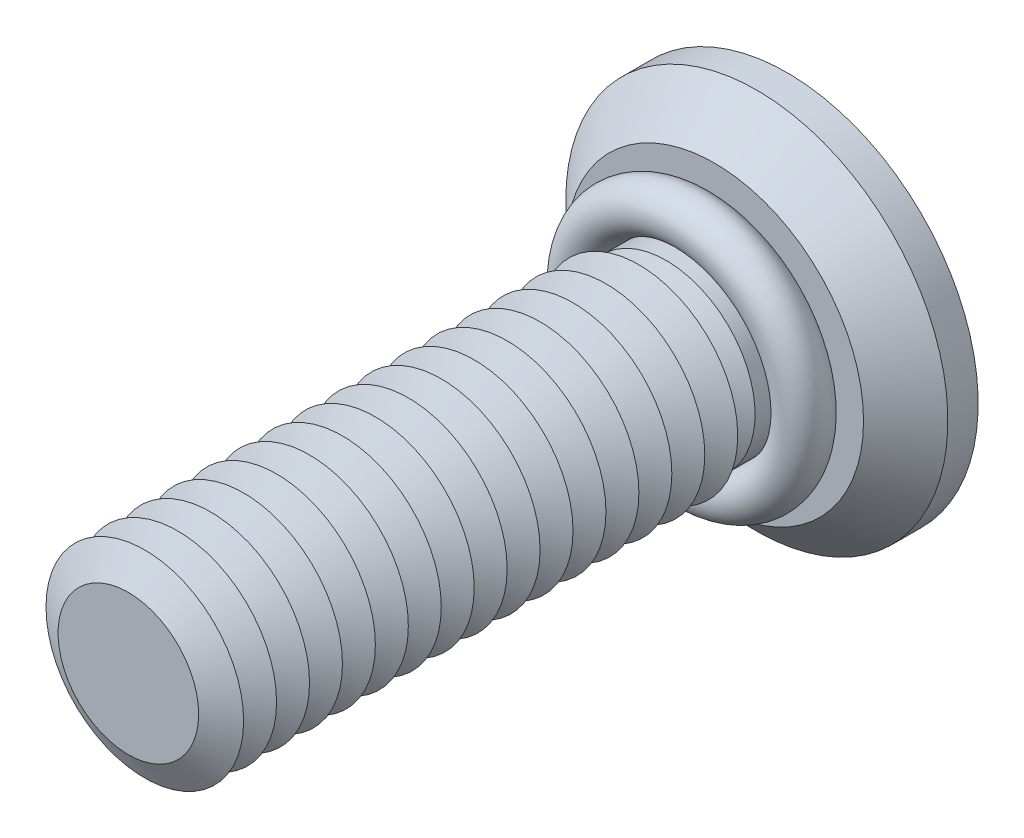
ISO-10303-21;
HEADER;
FILE_DESCRIPTION(('STEP AP214'),'2;1');
FILE_NAME('part.step','',(''),(''),'','','');
FILE_SCHEMA(('AUTOMOTIVE_DESIGN { 1 0 10303 214 1 1 1 1 }'));
ENDSEC;
DATA;
#1=APPLICATION_CONTEXT('core data for automotive mechanical design processes');
#2=APPLICATION_PROTOCOL_DEFINITION('international standard','automotive_design',2000,#1);
#3=PRODUCT_CONTEXT('',#1,'mechanical');
#4=PRODUCT('Part','Part','',(#3));
#5=PRODUCT_RELATED_PRODUCT_CATEGORY('part','',(#4));
#6=PRODUCT_DEFINITION_FORMATION('','',#4);
#7=PRODUCT_DEFINITION_CONTEXT('part definition',#1,'design');
#8=PRODUCT_DEFINITION('design','',#6,#7);
#9=PRODUCT_DEFINITION_SHAPE('','',#8);
#10=(LENGTH_UNIT() NAMED_UNIT(*) SI_UNIT(.MILLI.,.METRE.));
#11=(NAMED_UNIT(*) PLANE_ANGLE_UNIT() SI_UNIT($,.RADIAN.));
#12=(NAMED_UNIT(*) SI_UNIT($,.STERADIAN.) SOLID_ANGLE_UNIT());
#13=UNCERTAINTY_MEASURE_WITH_UNIT(LENGTH_MEASURE(1.E-05),#10,'distance_accuracy_value','');
#14=(GEOMETRIC_REPRESENTATION_CONTEXT(3) GLOBAL_UNCERTAINTY_ASSIGNED_CONTEXT((#13)) GLOBAL_UNIT_ASSIGNED_CONTEXT((#10,
#11,#12)) REPRESENTATION_CONTEXT('',''));
#15=CARTESIAN_POINT('',(0.,0.,0.));
#16=DIRECTION('',(0.,0.,1.));
#17=DIRECTION('',(1.,0.,0.));
#18=AXIS2_PLACEMENT_3D('',#15,#16,#17);
#19=CARTESIAN_POINT('',(0.,0.,1.45000000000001));
#20=DIRECTION('',(0.,0.,1.));
#21=DIRECTION('',(1.,0.,0.));
#22=AXIS2_PLACEMENT_3D('',#19,#20,#21);
#23=TOROIDAL_SURFACE('',#22,1.7,0.35);
#24=CARTESIAN_POINT('',(0.,1.7,1.45000000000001));
#25=DIRECTION('',(1.,0.,0.));
#26=DIRECTION('',(0.,0.,-1.));
#27=AXIS2_PLACEMENT_3D('',#24,#25,#26);
#28=CIRCLE('',#27,0.35);
#29=CARTESIAN_POINT('',(0.,2.05,1.45000000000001));
#30=VERTEX_POINT('',#29);
#31=EDGE_CURVE('P0_E10',#30,#30,#28,.T.);
#32=CARTESIAN_POINT('',(0.,0.,1.45000000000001));
#33=DIRECTION('',(0.,0.,1.));
#34=DIRECTION('',(1.,0.,0.));
#35=AXIS2_PLACEMENT_3D('',#32,#33,#34);
#36=CIRCLE('',#35,2.05);
#37=EDGE_CURVE('',#30,#30,#36,.T.);
#38=ORIENTED_EDGE('',*,*,#31,.F.);
#39=ORIENTED_EDGE('',*,*,#31,.T.);
#40=ORIENTED_EDGE('',*,*,#37,.T.);
#41=ORIENTED_EDGE('',*,*,#37,.F.);
#42=EDGE_LOOP('',(#38,#40,#39,#41));
#43=FACE_BOUND('',#42,.T.);
#44=ADVANCED_FACE('P0_F14',(#43),#23,.T.);
#45=CLOSED_SHELL('',(#44));
#46=MANIFOLD_SOLID_BREP('P0_B1',#45);
#47=CARTESIAN_POINT('',(0.,0.,7.5));
#48=DIRECTION('',(0.,0.,-1.));
#49=DIRECTION('',(-1.,0.,0.));
#50=AXIS2_PLACEMENT_3D('',#47,#48,#49);
#51=CONICAL_SURFACE('',#50,1.06698729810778,1.0471975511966);
#52=CARTESIAN_POINT('',(0.,0.,7.25));
#53=DIRECTION('',(0.,0.,1.));
#54=DIRECTION('',(1.,0.,0.));
#55=AXIS2_PLACEMENT_3D('',#52,#53,#54);
#56=CIRCLE('',#55,1.5);
#57=CARTESIAN_POINT('',(1.5,0.,7.25));
#58=VERTEX_POINT('',#57);
#59=EDGE_CURVE('P1_E324',#58,#58,#56,.T.);
#60=ORIENTED_EDGE('',*,*,#59,.T.);
#61=EDGE_LOOP('',(#60));
#62=FACE_BOUND('',#61,.T.);
#63=CARTESIAN_POINT('',(0.,0.,7.5));
#64=DIRECTION('',(0.,0.,1.));
#65=DIRECTION('',(1.,0.,0.));
#66=AXIS2_PLACEMENT_3D('',#63,#64,#65);
#67=CIRCLE('',#66,1.06698729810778);
#68=CARTESIAN_POINT('',(1.06698729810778,0.,7.5));
#69=VERTEX_POINT('',#68);
#70=EDGE_CURVE('P1_E321',#69,#69,#67,.T.);
#71=ORIENTED_EDGE('',*,*,#70,.F.);
#72=EDGE_LOOP('',(#71));
#73=FACE_BOUND('',#72,.T.);
#74=ADVANCED_FACE('P1_F15',(#62,#73),#51,.T.);
#75=CARTESIAN_POINT('',(0.,0.,7.75));
#76=DIRECTION('',(0.,0.,1.));
#77=DIRECTION('',(1.,0.,0.));
#78=AXIS2_PLACEMENT_3D('',#75,#76,#77);
#79=CONICAL_SURFACE('',#78,1.5,1.0471975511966);
#80=ORIENTED_EDGE('',*,*,#70,.T.);
#81=EDGE_LOOP('',(#80));
#82=FACE_BOUND('',#81,.T.);
#83=CARTESIAN_POINT('',(0.,0.,7.75));
#84=DIRECTION('',(0.,0.,1.));
#85=DIRECTION('',(1.,0.,0.));
#86=AXIS2_PLACEMENT_3D('',#83,#84,#85);
#87=CIRCLE('',#86,1.5);
#88=CARTESIAN_POINT('',(1.5,0.,7.75));
#89=VERTEX_POINT('',#88);
#90=EDGE_CURVE('P1_E318',#89,#89,#87,.T.);
#91=ORIENTED_EDGE('',*,*,#90,.F.);
#92=EDGE_LOOP('',(#91));
#93=FACE_BOUND('',#92,.T.);
#94=ADVANCED_FACE('P1_F245',(#82,#93),#79,.T.);
#95=CARTESIAN_POINT('',(0.,0.,10.));
#96=DIRECTION('',(0.,0.,1.));
#97=DIRECTION('',(1.,0.,0.));
#98=AXIS2_PLACEMENT_3D('',#95,#96,#97);
#99=PLANE('',#98);
#100=CARTESIAN_POINT('',(0.,0.,10.));
#101=DIRECTION('',(0.,0.,1.));
#102=DIRECTION('',(1.,0.,0.));
#103=AXIS2_PLACEMENT_3D('',#100,#101,#102);
#104=CIRCLE('',#103,1.06698729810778);
#105=CARTESIAN_POINT('',(1.06698729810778,0.,10.));
#106=VERTEX_POINT('',#105);
#107=EDGE_CURVE('P1_E131',#106,#106,#104,.T.);
#108=ORIENTED_EDGE('',*,*,#107,.T.);
#109=EDGE_LOOP('',(#108));
#110=FACE_BOUND('',#109,.T.);
#111=ADVANCED_FACE('P1_F251',(#110),#99,.T.);
#112=CARTESIAN_POINT('',(0.,0.,10.));
#113=DIRECTION('',(0.,0.,-1.));
#114=DIRECTION('',(-1.,0.,0.));
#115=AXIS2_PLACEMENT_3D('',#112,#113,#114);
#116=CONICAL_SURFACE('',#115,1.06698729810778,1.0471975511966);
#117=CARTESIAN_POINT('',(0.,0.,9.75));
#118=DIRECTION('',(0.,0.,1.));
#119=DIRECTION('',(1.,0.,0.));
#120=AXIS2_PLACEMENT_3D('',#117,#118,#119);
#121=CIRCLE('',#120,1.5);
#122=CARTESIAN_POINT('',(1.5,0.,9.75));
#123=VERTEX_POINT('',#122);
#124=EDGE_CURVE('P1_E133',#123,#123,#121,.T.);
#125=ORIENTED_EDGE('',*,*,#124,.T.);
#126=EDGE_LOOP('',(#125));
#127=FACE_BOUND('',#126,.T.);
#128=ORIENTED_EDGE('',*,*,#107,.F.);
#129=EDGE_LOOP('',(#128));
#130=FACE_BOUND('',#129,.T.);
#131=ADVANCED_FACE('P1_F196',(#127,#130),#116,.T.);
#132=CARTESIAN_POINT('',(0.,0.,9.75));
#133=DIRECTION('',(0.,0.,1.));
#134=DIRECTION('',(1.,0.,0.));
#135=AXIS2_PLACEMENT_3D('',#132,#133,#134);
#136=CONICAL_SURFACE('',#135,1.5,1.0471975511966);
#137=CARTESIAN_POINT('',(0.,0.,9.5));
#138=DIRECTION('',(0.,0.,1.));
#139=DIRECTION('',(1.,0.,0.));
#140=AXIS2_PLACEMENT_3D('',#137,#138,#139);
#141=CIRCLE('',#140,1.06698729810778);
#142=CARTESIAN_POINT('',(1.06698729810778,0.,9.5));
#143=VERTEX_POINT('',#142);
#144=EDGE_CURVE('P1_E297',#143,#143,#141,.T.);
#145=ORIENTED_EDGE('',*,*,#144,.T.);
#146=EDGE_LOOP('',(#145));
#147=FACE_BOUND('',#146,.T.);
#148=ORIENTED_EDGE('',*,*,#124,.F.);
#149=EDGE_LOOP('',(#148));
#150=FACE_BOUND('',#149,.T.);
#151=ADVANCED_FACE('P1_F284',(#147,#150),#136,.T.);
#152=CARTESIAN_POINT('',(0.,0.,9.5));
#153=DIRECTION('',(0.,0.,-1.));
#154=DIRECTION('',(-1.,0.,0.));
#155=AXIS2_PLACEMENT_3D('',#152,#153,#154);
#156=CONICAL_SURFACE('',#155,1.06698729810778,1.0471975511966);
#157=CARTESIAN_POINT('',(0.,0.,9.25));
#158=DIRECTION('',(0.,0.,1.));
#159=DIRECTION('',(1.,0.,0.));
#160=AXIS2_PLACEMENT_3D('',#157,#158,#159);
#161=CIRCLE('',#160,1.5);
#162=CARTESIAN_POINT('',(1.5,0.,9.25));
#163=VERTEX_POINT('',#162);
#164=EDGE_CURVE('P1_E294',#163,#163,#161,.T.);
#165=ORIENTED_EDGE('',*,*,#164,.T.);
#166=EDGE_LOOP('',(#165));
#167=FACE_BOUND('',#166,.T.);
#168=ORIENTED_EDGE('',*,*,#144,.F.);
#169=EDGE_LOOP('',(#168));
#170=FACE_BOUND('',#169,.T.);
#171=ADVANCED_FACE('P1_F279',(#167,#170),#156,.T.);
#172=CARTESIAN_POINT('',(0.,0.,9.25));
#173=DIRECTION('',(0.,0.,1.));
#174=DIRECTION('',(1.,0.,0.));
#175=AXIS2_PLACEMENT_3D('',#172,#173,#174);
#176=CONICAL_SURFACE('',#175,1.5,1.0471975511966);
#177=CARTESIAN_POINT('',(0.,0.,9.));
#178=DIRECTION('',(0.,0.,1.));
#179=DIRECTION('',(1.,0.,0.));
#180=AXIS2_PLACEMENT_3D('',#177,#178,#179);
#181=CIRCLE('',#180,1.06698729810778);
#182=CARTESIAN_POINT('',(1.06698729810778,0.,9.));
#183=VERTEX_POINT('',#182);
#184=EDGE_CURVE('P1_E301',#183,#183,#181,.T.);
#185=ORIENTED_EDGE('',*,*,#184,.T.);
#186=EDGE_LOOP('',(#185));
#187=FACE_BOUND('',#186,.T.);
#188=ORIENTED_EDGE('',*,*,#164,.F.);
#189=EDGE_LOOP('',(#188));
#190=FACE_BOUND('',#189,.T.);
#191=ADVANCED_FACE('P1_F276',(#187,#190),#176,.T.);
#192=CARTESIAN_POINT('',(0.,0.,9.));
#193=DIRECTION('',(0.,0.,-1.));
#194=DIRECTION('',(-1.,0.,0.));
#195=AXIS2_PLACEMENT_3D('',#192,#193,#194);
#196=CONICAL_SURFACE('',#195,1.06698729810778,1.0471975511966);
#197=CARTESIAN_POINT('',(0.,0.,8.75));
#198=DIRECTION('',(0.,0.,1.));
#199=DIRECTION('',(1.,0.,0.));
#200=AXIS2_PLACEMENT_3D('',#197,#198,#199);
#201=CIRCLE('',#200,1.5);
#202=CARTESIAN_POINT('',(1.5,0.,8.75));
#203=VERTEX_POINT('',#202);
#204=EDGE_CURVE('P1_E306',#203,#203,#201,.T.);
#205=ORIENTED_EDGE('',*,*,#204,.T.);
#206=EDGE_LOOP('',(#205));
#207=FACE_BOUND('',#206,.T.);
#208=ORIENTED_EDGE('',*,*,#184,.F.);
#209=EDGE_LOOP('',(#208));
#210=FACE_BOUND('',#209,.T.);
#211=ADVANCED_FACE('P1_F271',(#207,#210),#196,.T.);
#212=CARTESIAN_POINT('',(0.,0.,8.75));
#213=DIRECTION('',(0.,0.,1.));
#214=DIRECTION('',(1.,0.,0.));
#215=AXIS2_PLACEMENT_3D('',#212,#213,#214);
#216=CONICAL_SURFACE('',#215,1.5,1.0471975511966);
#217=CARTESIAN_POINT('',(0.,0.,8.5));
#218=DIRECTION('',(0.,0.,1.));
#219=DIRECTION('',(1.,0.,0.));
#220=AXIS2_PLACEMENT_3D('',#217,#218,#219);
#221=CIRCLE('',#220,1.06698729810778);
#222=CARTESIAN_POINT('',(1.06698729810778,0.,8.5));
#223=VERTEX_POINT('',#222);
#224=EDGE_CURVE('P1_E309',#223,#223,#221,.T.);
#225=ORIENTED_EDGE('',*,*,#224,.T.);
#226=EDGE_LOOP('',(#225));
#227=FACE_BOUND('',#226,.T.);
#228=ORIENTED_EDGE('',*,*,#204,.F.);
#229=EDGE_LOOP('',(#228));
#230=FACE_BOUND('',#229,.T.);
#231=ADVANCED_FACE('P1_F268',(#227,#230),#216,.T.);
#232=CARTESIAN_POINT('',(0.,0.,8.5));
#233=DIRECTION('',(0.,0.,-1.));
#234=DIRECTION('',(-1.,0.,0.));
#235=AXIS2_PLACEMENT_3D('',#232,#233,#234);
#236=CONICAL_SURFACE('',#235,1.06698729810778,1.0471975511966);
#237=CARTESIAN_POINT('',(0.,0.,8.25));
#238=DIRECTION('',(0.,0.,1.));
#239=DIRECTION('',(1.,0.,0.));
#240=AXIS2_PLACEMENT_3D('',#237,#238,#239);
#241=CIRCLE('',#240,1.5);
#242=CARTESIAN_POINT('',(1.5,0.,8.25));
#243=VERTEX_POINT('',#242);
#244=EDGE_CURVE('P1_E312',#243,#243,#241,.T.);
#245=ORIENTED_EDGE('',*,*,#244,.T.);
#246=EDGE_LOOP('',(#245));
#247=FACE_BOUND('',#246,.T.);
#248=ORIENTED_EDGE('',*,*,#224,.F.);
#249=EDGE_LOOP('',(#248));
#250=FACE_BOUND('',#249,.T.);
#251=ADVANCED_FACE('P1_F262',(#247,#250),#236,.T.);
#252=CARTESIAN_POINT('',(0.,0.,8.25));
#253=DIRECTION('',(0.,0.,1.));
#254=DIRECTION('',(1.,0.,0.));
#255=AXIS2_PLACEMENT_3D('',#252,#253,#254);
#256=CONICAL_SURFACE('',#255,1.5,1.0471975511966);
#257=CARTESIAN_POINT('',(0.,0.,8.));
#258=DIRECTION('',(0.,0.,1.));
#259=DIRECTION('',(1.,0.,0.));
#260=AXIS2_PLACEMENT_3D('',#257,#258,#259);
#261=CIRCLE('',#260,1.06698729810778);
#262=CARTESIAN_POINT('',(1.06698729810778,0.,8.));
#263=VERTEX_POINT('',#262);
#264=EDGE_CURVE('P1_E315',#263,#263,#261,.T.);
#265=ORIENTED_EDGE('',*,*,#264,.T.);
#266=EDGE_LOOP('',(#265));
#267=FACE_BOUND('',#266,.T.);
#268=ORIENTED_EDGE('',*,*,#244,.F.);
#269=EDGE_LOOP('',(#268));
#270=FACE_BOUND('',#269,.T.);
#271=ADVANCED_FACE('P1_F258',(#267,#270),#256,.T.);
#272=CARTESIAN_POINT('',(0.,0.,8.));
#273=DIRECTION('',(0.,0.,-1.));
#274=DIRECTION('',(-1.,0.,0.));
#275=AXIS2_PLACEMENT_3D('',#272,#273,#274);
#276=CONICAL_SURFACE('',#275,1.06698729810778,1.0471975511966);
#277=ORIENTED_EDGE('',*,*,#90,.T.);
#278=EDGE_LOOP('',(#277));
#279=FACE_BOUND('',#278,.T.);
#280=ORIENTED_EDGE('',*,*,#264,.F.);
#281=EDGE_LOOP('',(#280));
#282=FACE_BOUND('',#281,.T.);
#283=ADVANCED_FACE('P1_F261',(#279,#282),#276,.T.);
#284=CARTESIAN_POINT('',(0.,0.,7.));
#285=DIRECTION('',(0.,0.,-1.));
#286=DIRECTION('',(-1.,0.,0.));
#287=AXIS2_PLACEMENT_3D('',#284,#285,#286);
#288=CONICAL_SURFACE('',#287,1.06698729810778,1.0471975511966);
#289=CARTESIAN_POINT('',(0.,0.,6.75));
#290=DIRECTION('',(0.,0.,1.));
#291=DIRECTION('',(1.,0.,0.));
#292=AXIS2_PLACEMENT_3D('',#289,#290,#291);
#293=CIRCLE('',#292,1.5);
#294=CARTESIAN_POINT('',(1.5,0.,6.75));
#295=VERTEX_POINT('',#294);
#296=EDGE_CURVE('P1_E329',#295,#295,#293,.T.);
#297=ORIENTED_EDGE('',*,*,#296,.T.);
#298=EDGE_LOOP('',(#297));
#299=FACE_BOUND('',#298,.T.);
#300=CARTESIAN_POINT('',(0.,0.,7.));
#301=DIRECTION('',(0.,0.,1.));
#302=DIRECTION('',(1.,0.,0.));
#303=AXIS2_PLACEMENT_3D('',#300,#301,#302);
#304=CIRCLE('',#303,1.06698729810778);
#305=CARTESIAN_POINT('',(1.06698729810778,0.,7.));
#306=VERTEX_POINT('',#305);
#307=EDGE_CURVE('P1_E326',#306,#306,#304,.T.);
#308=ORIENTED_EDGE('',*,*,#307,.F.);
#309=EDGE_LOOP('',(#308));
#310=FACE_BOUND('',#309,.T.);
#311=ADVANCED_FACE('P1_F266',(#299,#310),#288,.T.);
#312=CARTESIAN_POINT('',(0.,0.,7.25));
#313=DIRECTION('',(0.,0.,1.));
#314=DIRECTION('',(1.,0.,0.));
#315=AXIS2_PLACEMENT_3D('',#312,#313,#314);
#316=CONICAL_SURFACE('',#315,1.5,1.0471975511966);
#317=ORIENTED_EDGE('',*,*,#307,.T.);
#318=EDGE_LOOP('',(#317));
#319=FACE_BOUND('',#318,.T.);
#320=ORIENTED_EDGE('',*,*,#59,.F.);
#321=EDGE_LOOP('',(#320));
#322=FACE_BOUND('',#321,.T.);
#323=ADVANCED_FACE('P1_F491',(#319,#322),#316,.T.);
#324=CARTESIAN_POINT('',(0.,0.,6.5));
#325=DIRECTION('',(0.,0.,-1.));
#326=DIRECTION('',(-1.,0.,0.));
#327=AXIS2_PLACEMENT_3D('',#324,#325,#326);
#328=CONICAL_SURFACE('',#327,1.06698729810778,1.0471975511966);
#329=CARTESIAN_POINT('',(0.,0.,6.25));
#330=DIRECTION('',(0.,0.,1.));
#331=DIRECTION('',(1.,0.,0.));
#332=AXIS2_PLACEMENT_3D('',#329,#330,#331);
#333=CIRCLE('',#332,1.5);
#334=CARTESIAN_POINT('',(1.5,0.,6.25));
#335=VERTEX_POINT('',#334);
#336=EDGE_CURVE('P1_E335',#335,#335,#333,.T.);
#337=ORIENTED_EDGE('',*,*,#336,.T.);
#338=EDGE_LOOP('',(#337));
#339=FACE_BOUND('',#338,.T.);
#340=CARTESIAN_POINT('',(0.,0.,6.5));
#341=DIRECTION('',(0.,0.,1.));
#342=DIRECTION('',(1.,0.,0.));
#343=AXIS2_PLACEMENT_3D('',#340,#341,#342);
#344=CIRCLE('',#343,1.06698729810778);
#345=CARTESIAN_POINT('',(1.06698729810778,0.,6.5));
#346=VERTEX_POINT('',#345);
#347=EDGE_CURVE('P1_E332',#346,#346,#344,.T.);
#348=ORIENTED_EDGE('',*,*,#347,.F.);
#349=EDGE_LOOP('',(#348));
#350=FACE_BOUND('',#349,.T.);
#351=ADVANCED_FACE('P1_F500',(#339,#350),#328,.T.);
#352=CARTESIAN_POINT('',(0.,0.,6.75));
#353=DIRECTION('',(0.,0.,1.));
#354=DIRECTION('',(1.,0.,0.));
#355=AXIS2_PLACEMENT_3D('',#352,#353,#354);
#356=CONICAL_SURFACE('',#355,1.5,1.0471975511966);
#357=ORIENTED_EDGE('',*,*,#347,.T.);
#358=EDGE_LOOP('',(#357));
#359=FACE_BOUND('',#358,.T.);
#360=ORIENTED_EDGE('',*,*,#296,.F.);
#361=EDGE_LOOP('',(#360));
#362=FACE_BOUND('',#361,.T.);
#363=ADVANCED_FACE('P1_F510',(#359,#362),#356,.T.);
#364=CARTESIAN_POINT('',(0.,0.,6.));
#365=DIRECTION('',(0.,0.,-1.));
#366=DIRECTION('',(-1.,0.,0.));
#367=AXIS2_PLACEMENT_3D('',#364,#365,#366);
#368=CONICAL_SURFACE('',#367,1.06698729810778,1.0471975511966);
#369=CARTESIAN_POINT('',(0.,0.,5.75));
#370=DIRECTION('',(0.,0.,1.));
#371=DIRECTION('',(1.,0.,0.));
#372=AXIS2_PLACEMENT_3D('',#369,#370,#371);
#373=CIRCLE('',#372,1.5);
#374=CARTESIAN_POINT('',(1.5,0.,5.75));
#375=VERTEX_POINT('',#374);
#376=EDGE_CURVE('P1_E341',#375,#375,#373,.T.);
#377=ORIENTED_EDGE('',*,*,#376,.T.);
#378=EDGE_LOOP('',(#377));
#379=FACE_BOUND('',#378,.T.);
#380=CARTESIAN_POINT('',(0.,0.,6.));
#381=DIRECTION('',(0.,0.,1.));
#382=DIRECTION('',(1.,0.,0.));
#383=AXIS2_PLACEMENT_3D('',#380,#381,#382);
#384=CIRCLE('',#383,1.06698729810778);
#385=CARTESIAN_POINT('',(1.06698729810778,0.,6.));
#386=VERTEX_POINT('',#385);
#387=EDGE_CURVE('P1_E338',#386,#386,#384,.T.);
#388=ORIENTED_EDGE('',*,*,#387,.F.);
#389=EDGE_LOOP('',(#388));
#390=FACE_BOUND('',#389,.T.);
#391=ADVANCED_FACE('P1_F520',(#379,#390),#368,.T.);
#392=CARTESIAN_POINT('',(0.,0.,6.25));
#393=DIRECTION('',(0.,0.,1.));
#394=DIRECTION('',(1.,0.,0.));
#395=AXIS2_PLACEMENT_3D('',#392,#393,#394);
#396=CONICAL_SURFACE('',#395,1.5,1.0471975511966);
#397=ORIENTED_EDGE('',*,*,#387,.T.);
#398=EDGE_LOOP('',(#397));
#399=FACE_BOUND('',#398,.T.);
#400=ORIENTED_EDGE('',*,*,#336,.F.);
#401=EDGE_LOOP('',(#400));
#402=FACE_BOUND('',#401,.T.);
#403=ADVANCED_FACE('P1_F530',(#399,#402),#396,.T.);
#404=CARTESIAN_POINT('',(0.,0.,5.5));
#405=DIRECTION('',(0.,0.,-1.));
#406=DIRECTION('',(-1.,0.,0.));
#407=AXIS2_PLACEMENT_3D('',#404,#405,#406);
#408=CONICAL_SURFACE('',#407,1.06698729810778,1.0471975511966);
#409=CARTESIAN_POINT('',(0.,0.,5.25));
#410=DIRECTION('',(0.,0.,1.));
#411=DIRECTION('',(1.,0.,0.));
#412=AXIS2_PLACEMENT_3D('',#409,#410,#411);
#413=CIRCLE('',#412,1.5);
#414=CARTESIAN_POINT('',(1.5,0.,5.25));
#415=VERTEX_POINT('',#414);
#416=EDGE_CURVE('P1_E347',#415,#415,#413,.T.);
#417=ORIENTED_EDGE('',*,*,#416,.T.);
#418=EDGE_LOOP('',(#417));
#419=FACE_BOUND('',#418,.T.);
#420=CARTESIAN_POINT('',(0.,0.,5.5));
#421=DIRECTION('',(0.,0.,1.));
#422=DIRECTION('',(1.,0.,0.));
#423=AXIS2_PLACEMENT_3D('',#420,#421,#422);
#424=CIRCLE('',#423,1.06698729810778);
#425=CARTESIAN_POINT('',(1.06698729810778,0.,5.5));
#426=VERTEX_POINT('',#425);
#427=EDGE_CURVE('P1_E344',#426,#426,#424,.T.);
#428=ORIENTED_EDGE('',*,*,#427,.F.);
#429=EDGE_LOOP('',(#428));
#430=FACE_BOUND('',#429,.T.);
#431=ADVANCED_FACE('P1_F540',(#419,#430),#408,.T.);
#432=CARTESIAN_POINT('',(0.,0.,5.75));
#433=DIRECTION('',(0.,0.,1.));
#434=DIRECTION('',(1.,0.,0.));
#435=AXIS2_PLACEMENT_3D('',#432,#433,#434);
#436=CONICAL_SURFACE('',#435,1.5,1.0471975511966);
#437=ORIENTED_EDGE('',*,*,#427,.T.);
#438=EDGE_LOOP('',(#437));
#439=FACE_BOUND('',#438,.T.);
#440=ORIENTED_EDGE('',*,*,#376,.F.);
#441=EDGE_LOOP('',(#440));
#442=FACE_BOUND('',#441,.T.);
#443=ADVANCED_FACE('P1_F550',(#439,#442),#436,.T.);
#444=CARTESIAN_POINT('',(0.,0.,5.));
#445=DIRECTION('',(0.,0.,-1.));
#446=DIRECTION('',(-1.,0.,0.));
#447=AXIS2_PLACEMENT_3D('',#444,#445,#446);
#448=CONICAL_SURFACE('',#447,1.06698729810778,1.0471975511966);
#449=CARTESIAN_POINT('',(0.,0.,4.75));
#450=DIRECTION('',(0.,0.,1.));
#451=DIRECTION('',(1.,0.,0.));
#452=AXIS2_PLACEMENT_3D('',#449,#450,#451);
#453=CIRCLE('',#452,1.5);
#454=CARTESIAN_POINT('',(1.5,0.,4.75));
#455=VERTEX_POINT('',#454);
#456=EDGE_CURVE('P1_E353',#455,#455,#453,.T.);
#457=ORIENTED_EDGE('',*,*,#456,.T.);
#458=EDGE_LOOP('',(#457));
#459=FACE_BOUND('',#458,.T.);
#460=CARTESIAN_POINT('',(0.,0.,5.));
#461=DIRECTION('',(0.,0.,1.));
#462=DIRECTION('',(1.,0.,0.));
#463=AXIS2_PLACEMENT_3D('',#460,#461,#462);
#464=CIRCLE('',#463,1.06698729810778);
#465=CARTESIAN_POINT('',(1.06698729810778,0.,5.));
#466=VERTEX_POINT('',#465);
#467=EDGE_CURVE('P1_E350',#466,#466,#464,.T.);
#468=ORIENTED_EDGE('',*,*,#467,.F.);
#469=EDGE_LOOP('',(#468));
#470=FACE_BOUND('',#469,.T.);
#471=ADVANCED_FACE('P1_F560',(#459,#470),#448,.T.);
#472=CARTESIAN_POINT('',(0.,0.,5.25));
#473=DIRECTION('',(0.,0.,1.));
#474=DIRECTION('',(1.,0.,0.));
#475=AXIS2_PLACEMENT_3D('',#472,#473,#474);
#476=CONICAL_SURFACE('',#475,1.5,1.0471975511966);
#477=ORIENTED_EDGE('',*,*,#467,.T.);
#478=EDGE_LOOP('',(#477));
#479=FACE_BOUND('',#478,.T.);
#480=ORIENTED_EDGE('',*,*,#416,.F.);
#481=EDGE_LOOP('',(#480));
#482=FACE_BOUND('',#481,.T.);
#483=ADVANCED_FACE('P1_F570',(#479,#482),#476,.T.);
#484=CARTESIAN_POINT('',(0.,0.,4.5));
#485=DIRECTION('',(0.,0.,-1.));
#486=DIRECTION('',(-1.,0.,0.));
#487=AXIS2_PLACEMENT_3D('',#484,#485,#486);
#488=CONICAL_SURFACE('',#487,1.06698729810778,1.0471975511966);
#489=CARTESIAN_POINT('',(0.,0.,4.25));
#490=DIRECTION('',(0.,0.,1.));
#491=DIRECTION('',(1.,0.,0.));
#492=AXIS2_PLACEMENT_3D('',#489,#490,#491);
#493=CIRCLE('',#492,1.5);
#494=CARTESIAN_POINT('',(1.5,0.,4.25));
#495=VERTEX_POINT('',#494);
#496=EDGE_CURVE('P1_E359',#495,#495,#493,.T.);
#497=ORIENTED_EDGE('',*,*,#496,.T.);
#498=EDGE_LOOP('',(#497));
#499=FACE_BOUND('',#498,.T.);
#500=CARTESIAN_POINT('',(0.,0.,4.5));
#501=DIRECTION('',(0.,0.,1.));
#502=DIRECTION('',(1.,0.,0.));
#503=AXIS2_PLACEMENT_3D('',#500,#501,#502);
#504=CIRCLE('',#503,1.06698729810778);
#505=CARTESIAN_POINT('',(1.06698729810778,0.,4.5));
#506=VERTEX_POINT('',#505);
#507=EDGE_CURVE('P1_E356',#506,#506,#504,.T.);
#508=ORIENTED_EDGE('',*,*,#507,.F.);
#509=EDGE_LOOP('',(#508));
#510=FACE_BOUND('',#509,.T.);
#511=ADVANCED_FACE('P1_F580',(#499,#510),#488,.T.);
#512=CARTESIAN_POINT('',(0.,0.,4.75));
#513=DIRECTION('',(0.,0.,1.));
#514=DIRECTION('',(1.,0.,0.));
#515=AXIS2_PLACEMENT_3D('',#512,#513,#514);
#516=CONICAL_SURFACE('',#515,1.5,1.0471975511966);
#517=ORIENTED_EDGE('',*,*,#507,.T.);
#518=EDGE_LOOP('',(#517));
#519=FACE_BOUND('',#518,.T.);
#520=ORIENTED_EDGE('',*,*,#456,.F.);
#521=EDGE_LOOP('',(#520));
#522=FACE_BOUND('',#521,.T.);
#523=ADVANCED_FACE('P1_F590',(#519,#522),#516,.T.);
#524=CARTESIAN_POINT('',(0.,0.,4.));
#525=DIRECTION('',(0.,0.,-1.));
#526=DIRECTION('',(-1.,0.,0.));
#527=AXIS2_PLACEMENT_3D('',#524,#525,#526);
#528=CONICAL_SURFACE('',#527,1.06698729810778,1.0471975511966);
#529=CARTESIAN_POINT('',(0.,0.,3.75));
#530=DIRECTION('',(0.,0.,1.));
#531=DIRECTION('',(1.,0.,0.));
#532=AXIS2_PLACEMENT_3D('',#529,#530,#531);
#533=CIRCLE('',#532,1.5);
#534=CARTESIAN_POINT('',(1.5,0.,3.75));
#535=VERTEX_POINT('',#534);
#536=EDGE_CURVE('P1_E365',#535,#535,#533,.T.);
#537=ORIENTED_EDGE('',*,*,#536,.T.);
#538=EDGE_LOOP('',(#537));
#539=FACE_BOUND('',#538,.T.);
#540=CARTESIAN_POINT('',(0.,0.,4.));
#541=DIRECTION('',(0.,0.,1.));
#542=DIRECTION('',(1.,0.,0.));
#543=AXIS2_PLACEMENT_3D('',#540,#541,#542);
#544=CIRCLE('',#543,1.06698729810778);
#545=CARTESIAN_POINT('',(1.06698729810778,0.,4.));
#546=VERTEX_POINT('',#545);
#547=EDGE_CURVE('P1_E362',#546,#546,#544,.T.);
#548=ORIENTED_EDGE('',*,*,#547,.F.);
#549=EDGE_LOOP('',(#548));
#550=FACE_BOUND('',#549,.T.);
#551=ADVANCED_FACE('P1_F600',(#539,#550),#528,.T.);
#552=CARTESIAN_POINT('',(0.,0.,4.25));
#553=DIRECTION('',(0.,0.,1.));
#554=DIRECTION('',(1.,0.,0.));
#555=AXIS2_PLACEMENT_3D('',#552,#553,#554);
#556=CONICAL_SURFACE('',#555,1.5,1.0471975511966);
#557=ORIENTED_EDGE('',*,*,#547,.T.);
#558=EDGE_LOOP('',(#557));
#559=FACE_BOUND('',#558,.T.);
#560=ORIENTED_EDGE('',*,*,#496,.F.);
#561=EDGE_LOOP('',(#560));
#562=FACE_BOUND('',#561,.T.);
#563=ADVANCED_FACE('P1_F610',(#559,#562),#556,.T.);
#564=CARTESIAN_POINT('',(0.,0.,3.5));
#565=DIRECTION('',(0.,0.,-1.));
#566=DIRECTION('',(-1.,0.,0.));
#567=AXIS2_PLACEMENT_3D('',#564,#565,#566);
#568=CONICAL_SURFACE('',#567,1.06698729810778,1.0471975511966);
#569=CARTESIAN_POINT('',(0.,0.,3.25));
#570=DIRECTION('',(0.,0.,1.));
#571=DIRECTION('',(1.,0.,0.));
#572=AXIS2_PLACEMENT_3D('',#569,#570,#571);
#573=CIRCLE('',#572,1.5);
#574=CARTESIAN_POINT('',(1.5,0.,3.25));
#575=VERTEX_POINT('',#574);
#576=EDGE_CURVE('P1_E371',#575,#575,#573,.T.);
#577=ORIENTED_EDGE('',*,*,#576,.T.);
#578=EDGE_LOOP('',(#577));
#579=FACE_BOUND('',#578,.T.);
#580=CARTESIAN_POINT('',(0.,0.,3.5));
#581=DIRECTION('',(0.,0.,1.));
#582=DIRECTION('',(1.,0.,0.));
#583=AXIS2_PLACEMENT_3D('',#580,#581,#582);
#584=CIRCLE('',#583,1.06698729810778);
#585=CARTESIAN_POINT('',(1.06698729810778,0.,3.5));
#586=VERTEX_POINT('',#585);
#587=EDGE_CURVE('P1_E368',#586,#586,#584,.T.);
#588=ORIENTED_EDGE('',*,*,#587,.F.);
#589=EDGE_LOOP('',(#588));
#590=FACE_BOUND('',#589,.T.);
#591=ADVANCED_FACE('P1_F620',(#579,#590),#568,.T.);
#592=CARTESIAN_POINT('',(0.,0.,3.75));
#593=DIRECTION('',(0.,0.,1.));
#594=DIRECTION('',(1.,0.,0.));
#595=AXIS2_PLACEMENT_3D('',#592,#593,#594);
#596=CONICAL_SURFACE('',#595,1.5,1.0471975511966);
#597=ORIENTED_EDGE('',*,*,#587,.T.);
#598=EDGE_LOOP('',(#597));
#599=FACE_BOUND('',#598,.T.);
#600=ORIENTED_EDGE('',*,*,#536,.F.);
#601=EDGE_LOOP('',(#600));
#602=FACE_BOUND('',#601,.T.);
#603=ADVANCED_FACE('P1_F630',(#599,#602),#596,.T.);
#604=CARTESIAN_POINT('',(0.,0.,3.));
#605=DIRECTION('',(0.,0.,-1.));
#606=DIRECTION('',(-1.,0.,0.));
#607=AXIS2_PLACEMENT_3D('',#604,#605,#606);
#608=CONICAL_SURFACE('',#607,1.06698729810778,1.0471975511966);
#609=CARTESIAN_POINT('',(0.,0.,2.75));
#610=DIRECTION('',(0.,0.,1.));
#611=DIRECTION('',(1.,0.,0.));
#612=AXIS2_PLACEMENT_3D('',#609,#610,#611);
#613=CIRCLE('',#612,1.5);
#614=CARTESIAN_POINT('',(1.5,0.,2.75));
#615=VERTEX_POINT('',#614);
#616=EDGE_CURVE('P1_E377',#615,#615,#613,.T.);
#617=ORIENTED_EDGE('',*,*,#616,.T.);
#618=EDGE_LOOP('',(#617));
#619=FACE_BOUND('',#618,.T.);
#620=CARTESIAN_POINT('',(0.,0.,3.));
#621=DIRECTION('',(0.,0.,1.));
#622=DIRECTION('',(1.,0.,0.));
#623=AXIS2_PLACEMENT_3D('',#620,#621,#622);
#624=CIRCLE('',#623,1.06698729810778);
#625=CARTESIAN_POINT('',(1.06698729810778,0.,3.));
#626=VERTEX_POINT('',#625);
#627=EDGE_CURVE('P1_E374',#626,#626,#624,.T.);
#628=ORIENTED_EDGE('',*,*,#627,.F.);
#629=EDGE_LOOP('',(#628));
#630=FACE_BOUND('',#629,.T.);
#631=ADVANCED_FACE('P1_F640',(#619,#630),#608,.T.);
#632=CARTESIAN_POINT('',(0.,0.,3.25));
#633=DIRECTION('',(0.,0.,1.));
#634=DIRECTION('',(1.,0.,0.));
#635=AXIS2_PLACEMENT_3D('',#632,#633,#634);
#636=CONICAL_SURFACE('',#635,1.5,1.0471975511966);
#637=ORIENTED_EDGE('',*,*,#627,.T.);
#638=EDGE_LOOP('',(#637));
#639=FACE_BOUND('',#638,.T.);
#640=ORIENTED_EDGE('',*,*,#576,.F.);
#641=EDGE_LOOP('',(#640));
#642=FACE_BOUND('',#641,.T.);
#643=ADVANCED_FACE('P1_F650',(#639,#642),#636,.T.);
#644=CARTESIAN_POINT('',(0.,0.,2.5));
#645=DIRECTION('',(0.,0.,-1.));
#646=DIRECTION('',(-1.,0.,0.));
#647=AXIS2_PLACEMENT_3D('',#644,#645,#646);
#648=CONICAL_SURFACE('',#647,1.06698729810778,1.0471975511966);
#649=CARTESIAN_POINT('',(0.,0.,2.25));
#650=DIRECTION('',(0.,0.,1.));
#651=DIRECTION('',(1.,0.,0.));
#652=AXIS2_PLACEMENT_3D('',#649,#650,#651);
#653=CIRCLE('',#652,1.5);
#654=CARTESIAN_POINT('',(1.5,0.,2.25));
#655=VERTEX_POINT('',#654);
#656=EDGE_CURVE('P1_E383',#655,#655,#653,.T.);
#657=ORIENTED_EDGE('',*,*,#656,.T.);
#658=EDGE_LOOP('',(#657));
#659=FACE_BOUND('',#658,.T.);
#660=CARTESIAN_POINT('',(0.,0.,2.5));
#661=DIRECTION('',(0.,0.,1.));
#662=DIRECTION('',(1.,0.,0.));
#663=AXIS2_PLACEMENT_3D('',#660,#661,#662);
#664=CIRCLE('',#663,1.06698729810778);
#665=CARTESIAN_POINT('',(1.06698729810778,0.,2.5));
#666=VERTEX_POINT('',#665);
#667=EDGE_CURVE('P1_E380',#666,#666,#664,.T.);
#668=ORIENTED_EDGE('',*,*,#667,.F.);
#669=EDGE_LOOP('',(#668));
#670=FACE_BOUND('',#669,.T.);
#671=ADVANCED_FACE('P1_F660',(#659,#670),#648,.T.);
#672=CARTESIAN_POINT('',(0.,0.,2.75));
#673=DIRECTION('',(0.,0.,1.));
#674=DIRECTION('',(1.,0.,0.));
#675=AXIS2_PLACEMENT_3D('',#672,#673,#674);
#676=CONICAL_SURFACE('',#675,1.5,1.0471975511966);
#677=ORIENTED_EDGE('',*,*,#667,.T.);
#678=EDGE_LOOP('',(#677));
#679=FACE_BOUND('',#678,.T.);
#680=ORIENTED_EDGE('',*,*,#616,.F.);
#681=EDGE_LOOP('',(#680));
#682=FACE_BOUND('',#681,.T.);
#683=ADVANCED_FACE('P1_F396',(#679,#682),#676,.T.);
#684=CARTESIAN_POINT('',(0.,0.,2.));
#685=DIRECTION('',(0.,0.,-1.));
#686=DIRECTION('',(-1.,0.,0.));
#687=AXIS2_PLACEMENT_3D('',#684,#685,#686);
#688=CONICAL_SURFACE('',#687,1.06698729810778,1.0471975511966);
#689=CARTESIAN_POINT('',(0.,0.,2.));
#690=DIRECTION('',(0.,0.,1.));
#691=DIRECTION('',(1.,0.,0.));
#692=AXIS2_PLACEMENT_3D('',#689,#690,#691);
#693=CIRCLE('',#692,1.06698729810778);
#694=CARTESIAN_POINT('',(1.06698729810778,0.,2.));
#695=VERTEX_POINT('',#694);
#696=EDGE_CURVE('P1_E386',#695,#695,#693,.T.);
#697=ORIENTED_EDGE('',*,*,#696,.F.);
#698=EDGE_LOOP('',(#697));
#699=FACE_BOUND('',#698,.T.);
#700=CARTESIAN_POINT('',(0.,0.,1.83660254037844));
#701=DIRECTION('',(0.,0.,-1.));
#702=DIRECTION('',(-1.,0.,0.));
#703=AXIS2_PLACEMENT_3D('',#700,#701,#702);
#704=CIRCLE('',#703,1.35);
#705=CARTESIAN_POINT('',(-1.35,0.,1.83660254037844));
#706=VERTEX_POINT('',#705);
#707=EDGE_CURVE('P1_E19',#706,#706,#704,.F.);
#708=ORIENTED_EDGE('',*,*,#707,.T.);
#709=EDGE_LOOP('',(#708));
#710=FACE_BOUND('',#709,.T.);
#711=ADVANCED_FACE('P1_F393',(#699,#710),#688,.T.);
#712=CARTESIAN_POINT('',(0.,0.,2.25));
#713=DIRECTION('',(0.,0.,1.));
#714=DIRECTION('',(1.,0.,0.));
#715=AXIS2_PLACEMENT_3D('',#712,#713,#714);
#716=CONICAL_SURFACE('',#715,1.5,1.0471975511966);
#717=ORIENTED_EDGE('',*,*,#696,.T.);
#718=EDGE_LOOP('',(#717));
#719=FACE_BOUND('',#718,.T.);
#720=ORIENTED_EDGE('',*,*,#656,.F.);
#721=EDGE_LOOP('',(#720));
#722=FACE_BOUND('',#721,.T.);
#723=ADVANCED_FACE('P1_F390',(#719,#722),#716,.T.);
#724=CARTESIAN_POINT('',(0.,0.,1.2));
#725=DIRECTION('',(0.,0.,-1.));
#726=DIRECTION('',(-1.,0.,0.));
#727=AXIS2_PLACEMENT_3D('',#724,#725,#726);
#728=CONICAL_SURFACE('',#727,1.,1.0471975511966);
#729=CARTESIAN_POINT('',(0.,0.,1.77735026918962));
#730=VERTEX_POINT('',#729);
#731=VERTEX_LOOP('',#730);
#732=FACE_BOUND('',#731,.T.);
#733=CARTESIAN_POINT('',(0.,0.,1.2));
#734=DIRECTION('',(0.,0.,-1.));
#735=DIRECTION('',(-1.,0.,0.));
#736=AXIS2_PLACEMENT_3D('',#733,#734,#735);
#737=CIRCLE('',#736,1.);
#738=CARTESIAN_POINT('',(-1.,0.,1.2));
#739=VERTEX_POINT('',#738);
#740=CARTESIAN_POINT('',(-0.5,0.866025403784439,1.2));
#741=VERTEX_POINT('',#740);
#742=EDGE_CURVE('P1_E117',#739,#741,#737,.T.);
#743=ORIENTED_EDGE('',*,*,#742,.T.);
#744=CARTESIAN_POINT('',(0.,0.,1.2));
#745=DIRECTION('',(0.,0.,-1.));
#746=DIRECTION('',(-1.,0.,0.));
#747=AXIS2_PLACEMENT_3D('',#744,#745,#746);
#748=CIRCLE('',#747,1.);
#749=CARTESIAN_POINT('',(0.5,0.866025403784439,1.2));
#750=VERTEX_POINT('',#749);
#751=EDGE_CURVE('P1_E24',#741,#750,#748,.T.);
#752=ORIENTED_EDGE('',*,*,#751,.T.);
#753=CARTESIAN_POINT('',(1.,0.,1.2));
#754=VERTEX_POINT('',#753);
#755=EDGE_CURVE('P1_E895',#750,#754,#748,.T.);
#756=ORIENTED_EDGE('',*,*,#755,.T.);
#757=CARTESIAN_POINT('',(0.5,-0.866025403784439,1.2));
#758=VERTEX_POINT('',#757);
#759=EDGE_CURVE('P1_E888',#754,#758,#748,.T.);
#760=ORIENTED_EDGE('',*,*,#759,.T.);
#761=CARTESIAN_POINT('',(-0.499999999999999,-0.866025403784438,1.2));
#762=VERTEX_POINT('',#761);
#763=EDGE_CURVE('P1_E182',#758,#762,#748,.T.);
#764=ORIENTED_EDGE('',*,*,#763,.T.);
#765=EDGE_CURVE('P1_E179',#762,#739,#748,.T.);
#766=ORIENTED_EDGE('',*,*,#765,.T.);
#767=EDGE_LOOP('',(#743,#752,#756,#760,#764,#766));
#768=FACE_BOUND('',#767,.T.);
#769=ADVANCED_FACE('P1_F198',(#732,#768),#728,.F.);
#770=CARTESIAN_POINT('',(0.,0.,1.2));
#771=DIRECTION('',(0.,0.,-1.));
#772=DIRECTION('',(-1.,0.,0.));
#773=AXIS2_PLACEMENT_3D('',#770,#771,#772);
#774=PLANE('',#773);
#775=ORIENTED_EDGE('',*,*,#763,.F.);
#776=DIRECTION('',(-0.866025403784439,-0.5,0.));
#777=VECTOR('',#776,1.);
#778=CARTESIAN_POINT('',(1.,-0.577350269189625,1.2));
#779=LINE('',#778,#777);
#780=CARTESIAN_POINT('',(0.,-1.15470053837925,1.2));
#781=VERTEX_POINT('',#780);
#782=EDGE_CURVE('P1_E904',#758,#781,#779,.T.);
#783=ORIENTED_EDGE('',*,*,#782,.T.);
#784=DIRECTION('',(-0.866025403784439,0.5,0.));
#785=VECTOR('',#784,1.);
#786=CARTESIAN_POINT('',(0.,-1.15470053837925,1.2));
#787=LINE('',#786,#785);
#788=EDGE_CURVE('P1_E911',#781,#762,#787,.T.);
#789=ORIENTED_EDGE('',*,*,#788,.T.);
#790=EDGE_LOOP('',(#775,#783,#789));
#791=FACE_BOUND('',#790,.T.);
#792=ADVANCED_FACE('P1_F702',(#791),#774,.T.);
#793=ORIENTED_EDGE('',*,*,#765,.F.);
#794=CARTESIAN_POINT('',(-1.,-0.577350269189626,1.2));
#795=VERTEX_POINT('',#794);
#796=EDGE_CURVE('P1_E914',#762,#795,#787,.T.);
#797=ORIENTED_EDGE('',*,*,#796,.T.);
#798=DIRECTION('',(0.,1.,0.));
#799=VECTOR('',#798,1.);
#800=CARTESIAN_POINT('',(-1.,-0.577350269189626,1.2));
#801=LINE('',#800,#799);
#802=EDGE_CURVE('P1_E123',#795,#739,#801,.T.);
#803=ORIENTED_EDGE('',*,*,#802,.T.);
#804=EDGE_LOOP('',(#793,#797,#803));
#805=FACE_BOUND('',#804,.T.);
#806=ADVANCED_FACE('P1_F231',(#805),#774,.T.);
#807=ORIENTED_EDGE('',*,*,#742,.F.);
#808=CARTESIAN_POINT('',(-0.999999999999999,0.577350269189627,1.2));
#809=VERTEX_POINT('',#808);
#810=EDGE_CURVE('P1_E916',#739,#809,#801,.T.);
#811=ORIENTED_EDGE('',*,*,#810,.T.);
#812=DIRECTION('',(0.866025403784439,0.5,0.));
#813=VECTOR('',#812,1.);
#814=CARTESIAN_POINT('',(-0.999999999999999,0.577350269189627,1.2));
#815=LINE('',#814,#813);
#816=EDGE_CURVE('P1_E919',#809,#741,#815,.T.);
#817=ORIENTED_EDGE('',*,*,#816,.T.);
#818=EDGE_LOOP('',(#807,#811,#817));
#819=FACE_BOUND('',#818,.T.);
#820=ADVANCED_FACE('P1_F719',(#819),#774,.T.);
#821=ORIENTED_EDGE('',*,*,#751,.F.);
#822=CARTESIAN_POINT('',(0.,1.15470053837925,1.2));
#823=VERTEX_POINT('',#822);
#824=EDGE_CURVE('P1_E918',#741,#823,#815,.T.);
#825=ORIENTED_EDGE('',*,*,#824,.T.);
#826=DIRECTION('',(0.866025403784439,-0.5,0.));
#827=VECTOR('',#826,1.);
#828=CARTESIAN_POINT('',(0.,1.15470053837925,1.2));
#829=LINE('',#828,#827);
#830=EDGE_CURVE('P1_E161',#823,#750,#829,.T.);
#831=ORIENTED_EDGE('',*,*,#830,.T.);
#832=EDGE_LOOP('',(#821,#825,#831));
#833=FACE_BOUND('',#832,.T.);
#834=ADVANCED_FACE('P1_F728',(#833),#774,.T.);
#835=ORIENTED_EDGE('',*,*,#755,.F.);
#836=CARTESIAN_POINT('',(1.,0.577350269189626,1.2));
#837=VERTEX_POINT('',#836);
#838=EDGE_CURVE('P1_E903',#750,#837,#829,.T.);
#839=ORIENTED_EDGE('',*,*,#838,.T.);
#840=DIRECTION('',(0.,-1.,0.));
#841=VECTOR('',#840,1.);
#842=CARTESIAN_POINT('',(1.,0.577350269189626,1.2));
#843=LINE('',#842,#841);
#844=EDGE_CURVE('P1_E898',#837,#754,#843,.T.);
#845=ORIENTED_EDGE('',*,*,#844,.T.);
#846=EDGE_LOOP('',(#835,#839,#845));
#847=FACE_BOUND('',#846,.T.);
#848=ADVANCED_FACE('P1_F737',(#847),#774,.T.);
#849=ORIENTED_EDGE('',*,*,#759,.F.);
#850=CARTESIAN_POINT('',(1.,-0.577350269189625,1.2));
#851=VERTEX_POINT('',#850);
#852=EDGE_CURVE('P1_E890',#754,#851,#843,.T.);
#853=ORIENTED_EDGE('',*,*,#852,.T.);
#854=EDGE_CURVE('P1_E125',#851,#758,#779,.T.);
#855=ORIENTED_EDGE('',*,*,#854,.T.);
#856=EDGE_LOOP('',(#849,#853,#855));
#857=FACE_BOUND('',#856,.T.);
#858=ADVANCED_FACE('P1_F229',(#857),#774,.T.);
#859=CARTESIAN_POINT('',(1.,-0.577350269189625,1.2));
#860=DIRECTION('',(0.5,-0.866025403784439,0.));
#861=DIRECTION('',(0.866025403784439,0.5,0.));
#862=AXIS2_PLACEMENT_3D('',#859,#860,#861);
#863=PLANE('',#862);
#864=DIRECTION('',(0.,0.,-1.));
#865=VECTOR('',#864,1.);
#866=CARTESIAN_POINT('',(1.,-0.577350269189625,1.2));
#867=LINE('',#866,#865);
#868=CARTESIAN_POINT('',(1.,-0.577350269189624,0.));
#869=VERTEX_POINT('',#868);
#870=EDGE_CURVE('P1_E164',#851,#869,#867,.T.);
#871=ORIENTED_EDGE('',*,*,#870,.T.);
#872=CARTESIAN_POINT('',(1.0002,-0.577234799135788,-3.09447482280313E-05));
#873=CARTESIAN_POINT('',(0.958655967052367,-0.601220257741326,0.00640029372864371));
#874=CARTESIAN_POINT('',(0.917036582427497,-0.625249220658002,0.0122389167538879));
#875=CARTESIAN_POINT('',(0.833650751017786,-0.673392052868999,0.022496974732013));
#876=CARTESIAN_POINT('',(0.79188425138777,-0.697505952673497,0.0269158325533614));
#877=CARTESIAN_POINT('',(0.70845756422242,-0.745672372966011,0.0340762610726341));
#878=CARTESIAN_POINT('',(0.666797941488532,-0.769724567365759,0.036826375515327));
#879=CARTESIAN_POINT('',(0.583425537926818,-0.817859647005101,0.0405140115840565));
#880=CARTESIAN_POINT('',(0.541712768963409,-0.84194252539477,0.0414518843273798));
#881=CARTESIAN_POINT('',(0.458287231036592,-0.890108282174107,0.0414518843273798));
#882=CARTESIAN_POINT('',(0.416574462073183,-0.914191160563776,0.0405140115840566));
#883=CARTESIAN_POINT('',(0.333202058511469,-0.962326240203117,0.0368263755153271));
#884=CARTESIAN_POINT('',(0.291542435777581,-0.986378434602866,0.0340762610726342));
#885=CARTESIAN_POINT('',(0.208115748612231,-1.03454485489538,0.0269158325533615));
#886=CARTESIAN_POINT('',(0.166349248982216,-1.05865875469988,0.0224969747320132));
#887=CARTESIAN_POINT('',(0.0829634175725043,-1.10680158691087,0.012238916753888));
#888=CARTESIAN_POINT('',(0.0413440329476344,-1.13083054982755,0.00640029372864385));
#889=CARTESIAN_POINT('',(-0.000199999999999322,-1.15481600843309,-3.09447482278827E-05));
#890=B_SPLINE_CURVE_WITH_KNOTS('',3,(#872,#873,#874,#875,#876,#877,#878,#879,#880,#881,#882,
#883,#884,#885,#886,#887,#888,#889),.UNSPECIFIED.,.F.,.F.,(4,2,2,2,2,2,2,2,4),(0.,
0.145207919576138,0.290474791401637,0.434991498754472,0.579480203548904,0.723968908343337,
0.868485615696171,1.01375248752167,1.15896040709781),.UNSPECIFIED.);
#891=CARTESIAN_POINT('',(0.,-1.15470053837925,0.));
#892=VERTEX_POINT('',#891);
#893=EDGE_CURVE('P1_E118',#869,#892,#890,.T.);
#894=ORIENTED_EDGE('',*,*,#893,.T.);
#895=DIRECTION('',(0.,0.,-1.));
#896=VECTOR('',#895,1.);
#897=CARTESIAN_POINT('',(0.,-1.15470053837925,1.2));
#898=LINE('',#897,#896);
#899=EDGE_CURVE('P1_E116',#781,#892,#898,.T.);
#900=ORIENTED_EDGE('',*,*,#899,.F.);
#901=ORIENTED_EDGE('',*,*,#782,.F.);
#902=ORIENTED_EDGE('',*,*,#854,.F.);
#903=EDGE_LOOP('',(#871,#894,#900,#901,#902));
#904=FACE_BOUND('',#903,.T.);
#905=ADVANCED_FACE('P1_F226',(#904),#863,.F.);
#906=CARTESIAN_POINT('',(0.,-1.15470053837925,1.2));
#907=DIRECTION('',(-0.5,-0.866025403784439,0.));
#908=DIRECTION('',(0.866025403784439,-0.5,0.));
#909=AXIS2_PLACEMENT_3D('',#906,#907,#908);
#910=PLANE('',#909);
#911=ORIENTED_EDGE('',*,*,#899,.T.);
#912=CARTESIAN_POINT('',(0.000200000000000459,-1.15481600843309,-3.09447482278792E-05));
#913=CARTESIAN_POINT('',(-0.0413440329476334,-1.13083054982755,0.00640029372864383));
#914=CARTESIAN_POINT('',(-0.0829634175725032,-1.10680158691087,0.012238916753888));
#915=CARTESIAN_POINT('',(-0.166349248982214,-1.05865875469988,0.0224969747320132));
#916=CARTESIAN_POINT('',(-0.20811574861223,-1.03454485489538,0.0269158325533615));
#917=CARTESIAN_POINT('',(-0.29154243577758,-0.986378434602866,0.0340762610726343));
#918=CARTESIAN_POINT('',(-0.333202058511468,-0.962326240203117,0.0368263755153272));
#919=CARTESIAN_POINT('',(-0.416574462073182,-0.914191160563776,0.0405140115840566));
#920=CARTESIAN_POINT('',(-0.458287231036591,-0.890108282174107,0.0414518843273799));
#921=CARTESIAN_POINT('',(-0.541712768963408,-0.84194252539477,0.0414518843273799));
#922=CARTESIAN_POINT('',(-0.583425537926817,-0.817859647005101,0.0405140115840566));
#923=CARTESIAN_POINT('',(-0.666797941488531,-0.76972456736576,0.0368263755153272));
#924=CARTESIAN_POINT('',(-0.708457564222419,-0.745672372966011,0.0340762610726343));
#925=CARTESIAN_POINT('',(-0.791884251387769,-0.697505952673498,0.0269158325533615));
#926=CARTESIAN_POINT('',(-0.833650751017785,-0.673392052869,0.0224969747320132));
#927=CARTESIAN_POINT('',(-0.917036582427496,-0.625249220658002,0.012238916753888));
#928=CARTESIAN_POINT('',(-0.958655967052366,-0.601220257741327,0.00640029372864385));
#929=CARTESIAN_POINT('',(-1.0002,-0.577234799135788,-3.09447482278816E-05));
#930=B_SPLINE_CURVE_WITH_KNOTS('',3,(#912,#913,#914,#915,#916,#917,#918,#919,#920,#921,#922,
#923,#924,#925,#926,#927,#928,#929),.UNSPECIFIED.,.F.,.F.,(4,2,2,2,2,2,2,2,4),(0.,
0.145207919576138,0.290474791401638,0.434991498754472,0.579480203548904,0.723968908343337,
0.868485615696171,1.01375248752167,1.15896040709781),.UNSPECIFIED.);
#931=CARTESIAN_POINT('',(-1.,-0.577350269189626,0.));
#932=VERTEX_POINT('',#931);
#933=EDGE_CURVE('P1_E94',#892,#932,#930,.T.);
#934=ORIENTED_EDGE('',*,*,#933,.T.);
#935=DIRECTION('',(0.,0.,-1.));
#936=VECTOR('',#935,1.);
#937=CARTESIAN_POINT('',(-1.,-0.577350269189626,1.2));
#938=LINE('',#937,#936);
#939=EDGE_CURVE('P1_E112',#795,#932,#938,.T.);
#940=ORIENTED_EDGE('',*,*,#939,.F.);
#941=ORIENTED_EDGE('',*,*,#796,.F.);
#942=ORIENTED_EDGE('',*,*,#788,.F.);
#943=EDGE_LOOP('',(#911,#934,#940,#941,#942));
#944=FACE_BOUND('',#943,.T.);
#945=ADVANCED_FACE('P1_F110',(#944),#910,.F.);
#946=CARTESIAN_POINT('',(-1.,-0.577350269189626,1.2));
#947=DIRECTION('',(-1.,0.,0.));
#948=DIRECTION('',(0.,-1.,0.));
#949=AXIS2_PLACEMENT_3D('',#946,#947,#948);
#950=PLANE('',#949);
#951=ORIENTED_EDGE('',*,*,#939,.T.);
#952=CARTESIAN_POINT('',(-1.,-1.50720379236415,-0.175258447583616));
#953=CARTESIAN_POINT('',(-1.,-1.46204888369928,-0.165178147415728));
#954=CARTESIAN_POINT('',(-1.,-1.41686530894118,-0.155226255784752));
#955=CARTESIAN_POINT('',(-1.,-1.3264264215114,-0.135644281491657));
#956=CARTESIAN_POINT('',(-1.,-1.28117110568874,-0.126014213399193));
#957=CARTESIAN_POINT('',(-1.,-1.14519006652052,-0.0976864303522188));
#958=CARTESIAN_POINT('',(-1.,-1.05434091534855,-0.0795718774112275));
#959=CARTESIAN_POINT('',(-1.,-0.872985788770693,-0.0458587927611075));
#960=CARTESIAN_POINT('',(-1.,-0.782483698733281,-0.0302397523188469));
#961=CARTESIAN_POINT('',(-1.,-0.600935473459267,-0.00256781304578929));
#962=CARTESIAN_POINT('',(-1.,-0.509889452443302,0.00948580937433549));
#963=CARTESIAN_POINT('',(-1.,-0.326198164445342,0.0284754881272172));
#964=CARTESIAN_POINT('',(-1.,-0.233546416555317,0.0353525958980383));
#965=CARTESIAN_POINT('',(-1.,-0.0480110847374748,0.0422668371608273));
#966=CARTESIAN_POINT('',(-0.999999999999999,0.0448723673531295,0.0423072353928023));
#967=CARTESIAN_POINT('',(-0.999999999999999,0.230753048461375,0.0355315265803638));
#968=CARTESIAN_POINT('',(-0.999999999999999,0.323749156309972,0.0286870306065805));
#969=CARTESIAN_POINT('',(-0.999999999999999,0.509217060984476,0.00959637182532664));
#970=CARTESIAN_POINT('',(-0.999999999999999,0.601688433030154,-0.00265366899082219));
#971=CARTESIAN_POINT('',(-0.999999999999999,0.788469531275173,-0.0311825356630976));
#972=CARTESIAN_POINT('',(-0.999999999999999,0.882763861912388,-0.0475586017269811));
#973=CARTESIAN_POINT('',(-0.999999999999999,1.0708947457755,-0.082785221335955));
#974=CARTESIAN_POINT('',(-0.999999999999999,1.16473122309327,-0.101636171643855));
#975=CARTESIAN_POINT('',(-0.999999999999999,1.35209202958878,-0.140942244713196));
#976=CARTESIAN_POINT('',(-0.999999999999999,1.44561626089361,-0.16139782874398));
#977=CARTESIAN_POINT('',(-0.999999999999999,1.63242626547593,-0.203372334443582));
#978=CARTESIAN_POINT('',(-0.999999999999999,1.72571203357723,-0.224891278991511));
#979=CARTESIAN_POINT('',(-0.999999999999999,1.9109739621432,-0.26839206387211));
#980=CARTESIAN_POINT('',(-0.999999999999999,2.00295221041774,-0.290365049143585));
#981=CARTESIAN_POINT('',(-0.999999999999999,2.18678775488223,-0.334819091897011));
#982=CARTESIAN_POINT('',(-0.999999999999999,2.27864504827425,-0.35730016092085));
#983=CARTESIAN_POINT('',(-0.999999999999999,2.46214009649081,-0.402600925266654));
#984=CARTESIAN_POINT('',(-0.999999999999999,2.55377797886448,-0.425420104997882));
#985=CARTESIAN_POINT('',(-0.999999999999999,2.73697957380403,-0.471340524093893));
#986=CARTESIAN_POINT('',(-0.999999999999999,2.82854328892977,-0.494441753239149));
#987=CARTESIAN_POINT('',(-0.999999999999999,2.9200818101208,-0.517641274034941));
#988=B_SPLINE_CURVE_WITH_KNOTS('',3,(#952,#953,#954,#955,#956,#957,#958,#959,#960,#961,#962,
#963,#964,#965,#966,#967,#968,#969,#970,#971,#972,#973,#974,#975,#976,#977,#978,#979,#980,#981,
#982,#983,#984,#985,#986,#987),.UNSPECIFIED.,.F.,.F.,(4,2,2,2,2,2,2,2,2,2,2,2,2,2,2,2,2,4),(0.,
0.138798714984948,0.277603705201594,0.555495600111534,0.830971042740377,1.10639054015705,
1.38490086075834,1.66327818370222,1.94280808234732,2.22253884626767,2.50960639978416,
2.79672003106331,3.08391650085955,3.37111915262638,3.65481652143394,3.93852034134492,
4.22182877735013,4.50512697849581),.UNSPECIFIED.);
#989=CARTESIAN_POINT('',(-1.,0.577350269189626,0.));
#990=VERTEX_POINT('',#989);
#991=EDGE_CURVE('P1_E10',#932,#990,#988,.T.);
#992=ORIENTED_EDGE('',*,*,#991,.T.);
#993=DIRECTION('',(0.,0.,-1.));
#994=VECTOR('',#993,1.);
#995=CARTESIAN_POINT('',(-0.999999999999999,0.577350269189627,1.2));
#996=LINE('',#995,#994);
#997=EDGE_CURVE('P1_E124',#809,#990,#996,.T.);
#998=ORIENTED_EDGE('',*,*,#997,.F.);
#999=ORIENTED_EDGE('',*,*,#810,.F.);
#1000=ORIENTED_EDGE('',*,*,#802,.F.);
#1001=EDGE_LOOP('',(#951,#992,#998,#999,#1000));
#1002=FACE_BOUND('',#1001,.T.);
#1003=ADVANCED_FACE('P1_F120',(#1002),#950,.F.);
#1004=CARTESIAN_POINT('',(-0.999999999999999,0.577350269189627,1.2));
#1005=DIRECTION('',(-0.5,0.866025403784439,0.));
#1006=DIRECTION('',(-0.866025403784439,-0.5,0.));
#1007=AXIS2_PLACEMENT_3D('',#1004,#1005,#1006);
#1008=PLANE('',#1007);
#1009=ORIENTED_EDGE('',*,*,#997,.T.);
#1010=CARTESIAN_POINT('',(-1.0002,0.577234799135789,-3.09447482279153E-05));
#1011=CARTESIAN_POINT('',(-0.958655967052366,0.601220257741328,0.0064002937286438));
#1012=CARTESIAN_POINT('',(-0.917036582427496,0.625249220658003,0.0122389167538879));
#1013=CARTESIAN_POINT('',(-0.833650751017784,0.673392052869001,0.0224969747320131));
#1014=CARTESIAN_POINT('',(-0.791884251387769,0.697505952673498,0.0269158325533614));
#1015=CARTESIAN_POINT('',(-0.708457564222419,0.745672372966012,0.0340762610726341));
#1016=CARTESIAN_POINT('',(-0.666797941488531,0.76972456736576,0.036826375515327));
#1017=CARTESIAN_POINT('',(-0.583425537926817,0.817859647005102,0.0405140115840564));
#1018=CARTESIAN_POINT('',(-0.541712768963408,0.841942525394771,0.0414518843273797));
#1019=CARTESIAN_POINT('',(-0.458287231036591,0.890108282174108,0.0414518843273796));
#1020=CARTESIAN_POINT('',(-0.416574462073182,0.914191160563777,0.0405140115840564));
#1021=CARTESIAN_POINT('',(-0.333202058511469,0.962326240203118,0.0368263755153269));
#1022=CARTESIAN_POINT('',(-0.291542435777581,0.986378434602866,0.0340762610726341));
#1023=CARTESIAN_POINT('',(-0.208115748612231,1.03454485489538,0.0269158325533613));
#1024=CARTESIAN_POINT('',(-0.166349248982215,1.05865875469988,0.0224969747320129));
#1025=CARTESIAN_POINT('',(-0.0829634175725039,1.10680158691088,0.0122389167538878));
#1026=CARTESIAN_POINT('',(-0.041344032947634,1.13083054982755,0.00640029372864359));
#1027=CARTESIAN_POINT('',(0.0001999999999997,1.15481600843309,-3.09447482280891E-05));
#1028=B_SPLINE_CURVE_WITH_KNOTS('',3,(#1010,#1011,#1012,#1013,#1014,#1015,#1016,#1017,#1018,
#1019,#1020,#1021,#1022,#1023,#1024,#1025,#1026,#1027),.UNSPECIFIED.,.F.,.F.,(4,2,2,2,2,2,2,2,
4),(0.,0.145207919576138,0.290474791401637,0.434991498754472,0.579480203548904,
0.723968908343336,0.868485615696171,1.01375248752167,1.15896040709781),.UNSPECIFIED.);
#1029=CARTESIAN_POINT('',(0.,1.15470053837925,0.));
#1030=VERTEX_POINT('',#1029);
#1031=EDGE_CURVE('P1_E136',#990,#1030,#1028,.T.);
#1032=ORIENTED_EDGE('',*,*,#1031,.T.);
#1033=DIRECTION('',(0.,0.,-1.));
#1034=VECTOR('',#1033,1.);
#1035=CARTESIAN_POINT('',(0.,1.15470053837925,1.2));
#1036=LINE('',#1035,#1034);
#1037=EDGE_CURVE('P1_E155',#823,#1030,#1036,.T.);
#1038=ORIENTED_EDGE('',*,*,#1037,.F.);
#1039=ORIENTED_EDGE('',*,*,#824,.F.);
#1040=ORIENTED_EDGE('',*,*,#816,.F.);
#1041=EDGE_LOOP('',(#1009,#1032,#1038,#1039,#1040));
#1042=FACE_BOUND('',#1041,.T.);
#1043=ADVANCED_FACE('P1_F153',(#1042),#1008,.F.);
#1044=CARTESIAN_POINT('',(0.,1.15470053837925,1.2));
#1045=DIRECTION('',(0.5,0.866025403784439,0.));
#1046=DIRECTION('',(-0.866025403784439,0.5,0.));
#1047=AXIS2_PLACEMENT_3D('',#1044,#1045,#1046);
#1048=PLANE('',#1047);
#1049=ORIENTED_EDGE('',*,*,#1037,.T.);
#1050=CARTESIAN_POINT('',(-0.000199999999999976,1.15481600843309,-3.09447482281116E-05));
#1051=CARTESIAN_POINT('',(0.0413440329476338,1.13083054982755,0.00640029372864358));
#1052=CARTESIAN_POINT('',(0.0829634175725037,1.10680158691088,0.0122389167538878));
#1053=CARTESIAN_POINT('',(0.166349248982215,1.05865875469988,0.0224969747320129));
#1054=CARTESIAN_POINT('',(0.208115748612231,1.03454485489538,0.0269158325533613));
#1055=CARTESIAN_POINT('',(0.291542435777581,0.986378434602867,0.034076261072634));
#1056=CARTESIAN_POINT('',(0.333202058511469,0.962326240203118,0.0368263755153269));
#1057=CARTESIAN_POINT('',(0.416574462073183,0.914191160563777,0.0405140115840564));
#1058=CARTESIAN_POINT('',(0.458287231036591,0.890108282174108,0.0414518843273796));
#1059=CARTESIAN_POINT('',(0.541712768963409,0.841942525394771,0.0414518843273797));
#1060=CARTESIAN_POINT('',(0.583425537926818,0.817859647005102,0.0405140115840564));
#1061=CARTESIAN_POINT('',(0.666797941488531,0.769724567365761,0.0368263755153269));
#1062=CARTESIAN_POINT('',(0.708457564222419,0.745672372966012,0.034076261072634));
#1063=CARTESIAN_POINT('',(0.791884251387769,0.697505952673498,0.0269158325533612));
#1064=CARTESIAN_POINT('',(0.833650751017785,0.673392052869,0.0224969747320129));
#1065=CARTESIAN_POINT('',(0.917036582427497,0.625249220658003,0.0122389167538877));
#1066=CARTESIAN_POINT('',(0.958655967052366,0.601220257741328,0.00640029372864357));
#1067=CARTESIAN_POINT('',(1.0002,0.577234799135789,-3.09447482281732E-05));
#1068=B_SPLINE_CURVE_WITH_KNOTS('',3,(#1050,#1051,#1052,#1053,#1054,#1055,#1056,#1057,#1058,
#1059,#1060,#1061,#1062,#1063,#1064,#1065,#1066,#1067),.UNSPECIFIED.,.F.,.F.,(4,2,2,2,2,2,2,2,
4),(0.,0.145207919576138,0.290474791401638,0.434991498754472,0.579480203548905,
0.723968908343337,0.868485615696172,1.01375248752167,1.15896040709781),.UNSPECIFIED.);
#1069=CARTESIAN_POINT('',(1.,0.577350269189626,0.));
#1070=VERTEX_POINT('',#1069);
#1071=EDGE_CURVE('P1_E141',#1030,#1070,#1068,.T.);
#1072=ORIENTED_EDGE('',*,*,#1071,.T.);
#1073=DIRECTION('',(0.,0.,-1.));
#1074=VECTOR('',#1073,1.);
#1075=CARTESIAN_POINT('',(1.,0.577350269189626,1.2));
#1076=LINE('',#1075,#1074);
#1077=EDGE_CURVE('P1_E162',#837,#1070,#1076,.T.);
#1078=ORIENTED_EDGE('',*,*,#1077,.F.);
#1079=ORIENTED_EDGE('',*,*,#838,.F.);
#1080=ORIENTED_EDGE('',*,*,#830,.F.);
#1081=EDGE_LOOP('',(#1049,#1072,#1078,#1079,#1080));
#1082=FACE_BOUND('',#1081,.T.);
#1083=ADVANCED_FACE('P1_F158',(#1082),#1048,.F.);
#1084=CARTESIAN_POINT('',(1.,0.577350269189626,1.2));
#1085=DIRECTION('',(1.,0.,0.));
#1086=DIRECTION('',(0.,0.,-1.));
#1087=AXIS2_PLACEMENT_3D('',#1084,#1085,#1086);
#1088=PLANE('',#1087);
#1089=ORIENTED_EDGE('',*,*,#1077,.T.);
#1090=CARTESIAN_POINT('',(1.,-1.50720379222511,-0.175258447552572));
#1091=CARTESIAN_POINT('',(1.,-1.46204888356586,-0.165178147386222));
#1092=CARTESIAN_POINT('',(1.,-1.41686530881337,-0.155226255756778));
#1093=CARTESIAN_POINT('',(1.,-1.32642642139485,-0.135644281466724));
#1094=CARTESIAN_POINT('',(1.,-1.28117110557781,-0.126014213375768));
#1095=CARTESIAN_POINT('',(1.,-1.14519006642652,-0.0976864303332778));
#1096=CARTESIAN_POINT('',(1.,-1.05434091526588,-0.07957187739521));
#1097=CARTESIAN_POINT('',(1.,-0.872985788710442,-0.0458587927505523));
#1098=CARTESIAN_POINT('',(1.,-0.78248369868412,-0.0302397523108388));
#1099=CARTESIAN_POINT('',(1.,-0.600935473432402,-0.00256781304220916));
#1100=CARTESIAN_POINT('',(1.,-0.509889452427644,0.00948580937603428));
#1101=CARTESIAN_POINT('',(1.,-0.326198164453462,0.0284754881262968));
#1102=CARTESIAN_POINT('',(1.,-0.233546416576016,0.0353525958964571));
#1103=CARTESIAN_POINT('',(1.,-0.0480110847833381,0.0422668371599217));
#1104=CARTESIAN_POINT('',(1.,0.044872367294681,0.0423072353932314));
#1105=CARTESIAN_POINT('',(1.,0.230753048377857,0.0355315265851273));
#1106=CARTESIAN_POINT('',(1.,0.323749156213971,0.0286870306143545));
#1107=CARTESIAN_POINT('',(1.,0.50921706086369,0.00959637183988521));
#1108=CARTESIAN_POINT('',(1.,0.601688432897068,-0.0026536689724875));
#1109=CARTESIAN_POINT('',(1.,0.788469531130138,-0.0311825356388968));
#1110=CARTESIAN_POINT('',(1.,0.882763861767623,-0.0475586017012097));
#1111=CARTESIAN_POINT('',(1.,1.07089474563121,-0.0827852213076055));
#1112=CARTESIAN_POINT('',(1.,1.16473122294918,-0.101636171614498));
#1113=CARTESIAN_POINT('',(1.,1.35209202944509,-0.140942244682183));
#1114=CARTESIAN_POINT('',(1.,1.44561626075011,-0.16139782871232));
#1115=CARTESIAN_POINT('',(1.,1.63242626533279,-0.203372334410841));
#1116=CARTESIAN_POINT('',(1.,1.72571203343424,-0.224891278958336));
#1117=CARTESIAN_POINT('',(1.,1.91097396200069,-0.268392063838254));
#1118=CARTESIAN_POINT('',(1.,2.00295221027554,-0.290365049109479));
#1119=CARTESIAN_POINT('',(1.,2.18678775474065,-0.334819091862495));
#1120=CARTESIAN_POINT('',(1.,2.27864504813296,-0.357300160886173));
#1121=CARTESIAN_POINT('',(1.,2.46214009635,-0.402600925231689));
#1122=CARTESIAN_POINT('',(1.,2.55377797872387,-0.42542010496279));
#1123=CARTESIAN_POINT('',(1.,2.73697957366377,-0.471340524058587));
#1124=CARTESIAN_POINT('',(1.,2.82854328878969,-0.494441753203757));
#1125=CARTESIAN_POINT('',(1.,2.92008180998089,-0.517641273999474));
#1126=B_SPLINE_CURVE_WITH_KNOTS('',3,(#1090,#1091,#1092,#1093,#1094,#1095,#1096,#1097,#1098,
#1099,#1100,#1101,#1102,#1103,#1104,#1105,#1106,#1107,#1108,#1109,#1110,#1111,#1112,#1113,#1114,
#1115,#1116,#1117,#1118,#1119,#1120,#1121,#1122,#1123,#1124,#1125),.UNSPECIFIED.,.F.,.F.,(4,2,2,
2,2,2,2,2,2,2,2,2,2,2,2,2,2,4),(0.,0.138798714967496,0.277603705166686,0.555495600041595,
0.830971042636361,1.106390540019,1.38490086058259,1.66327818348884,1.94280808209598,
2.22253884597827,2.50960639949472,2.79672003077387,3.08391650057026,3.37111915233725,
3.65481652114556,3.93852034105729,4.22182877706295,4.50512697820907),.UNSPECIFIED.);
#1127=EDGE_CURVE('P1_E149',#1070,#869,#1126,.F.);
#1128=ORIENTED_EDGE('',*,*,#1127,.T.);
#1129=ORIENTED_EDGE('',*,*,#870,.F.);
#1130=ORIENTED_EDGE('',*,*,#852,.F.);
#1131=ORIENTED_EDGE('',*,*,#844,.F.);
#1132=EDGE_LOOP('',(#1089,#1128,#1129,#1130,#1131));
#1133=FACE_BOUND('',#1132,.T.);
#1134=ADVANCED_FACE('P1_F232',(#1133),#1088,.F.);
#1135=CARTESIAN_POINT('',(0.,0.,0.));
#1136=DIRECTION('',(0.,0.,-1.));
#1137=DIRECTION('',(-1.,0.,0.));
#1138=AXIS2_PLACEMENT_3D('',#1135,#1136,#1137);
#1139=CONICAL_SURFACE('',#1138,1.15470053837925,1.30899693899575);
#1140=CARTESIAN_POINT('',(0.,0.,0.));
#1141=DIRECTION('',(0.,0.,-1.));
#1142=DIRECTION('',(-1.,0.,0.));
#1143=AXIS2_PLACEMENT_3D('',#1140,#1141,#1142);
#1144=CIRCLE('',#1143,1.15470053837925);
#1145=EDGE_CURVE('P1_E30',#869,#892,#1144,.T.);
#1146=ORIENTED_EDGE('',*,*,#1145,.T.);
#1147=ORIENTED_EDGE('',*,*,#893,.F.);
#1148=EDGE_LOOP('',(#1146,#1147));
#1149=FACE_BOUND('',#1148,.T.);
#1150=ADVANCED_FACE('P1_F195',(#1149),#1139,.F.);
#1151=EDGE_CURVE('P1_E90',#892,#932,#1144,.T.);
#1152=ORIENTED_EDGE('',*,*,#1151,.T.);
#1153=ORIENTED_EDGE('',*,*,#933,.F.);
#1154=EDGE_LOOP('',(#1152,#1153));
#1155=FACE_BOUND('',#1154,.T.);
#1156=ADVANCED_FACE('P1_F92',(#1155),#1139,.F.);
#1157=EDGE_CURVE('P1_E98',#932,#990,#1144,.T.);
#1158=ORIENTED_EDGE('',*,*,#1157,.T.);
#1159=ORIENTED_EDGE('',*,*,#991,.F.);
#1160=EDGE_LOOP('',(#1158,#1159));
#1161=FACE_BOUND('',#1160,.T.);
#1162=ADVANCED_FACE('P1_F102',(#1161),#1139,.F.);
#1163=EDGE_CURVE('P1_E130',#990,#1030,#1144,.T.);
#1164=ORIENTED_EDGE('',*,*,#1163,.T.);
#1165=ORIENTED_EDGE('',*,*,#1031,.F.);
#1166=EDGE_LOOP('',(#1164,#1165));
#1167=FACE_BOUND('',#1166,.T.);
#1168=ADVANCED_FACE('P1_F811',(#1167),#1139,.F.);
#1169=EDGE_CURVE('P1_E137',#1030,#1070,#1144,.T.);
#1170=ORIENTED_EDGE('',*,*,#1169,.T.);
#1171=ORIENTED_EDGE('',*,*,#1071,.F.);
#1172=EDGE_LOOP('',(#1170,#1171));
#1173=FACE_BOUND('',#1172,.T.);
#1174=ADVANCED_FACE('P1_F144',(#1173),#1139,.F.);
#1175=EDGE_CURVE('P1_E37',#1070,#869,#1144,.T.);
#1176=ORIENTED_EDGE('',*,*,#1175,.T.);
#1177=ORIENTED_EDGE('',*,*,#1127,.F.);
#1178=EDGE_LOOP('',(#1176,#1177));
#1179=FACE_BOUND('',#1178,.T.);
#1180=ADVANCED_FACE('P1_F797',(#1179),#1139,.F.);
#1181=CARTESIAN_POINT('',(0.,0.,0.));
#1182=DIRECTION('',(0.,0.,1.));
#1183=DIRECTION('',(1.,0.,0.));
#1184=AXIS2_PLACEMENT_3D('',#1181,#1182,#1183);
#1185=PLANE('',#1184);
#1186=ORIENTED_EDGE('',*,*,#1175,.F.);
#1187=ORIENTED_EDGE('',*,*,#1169,.F.);
#1188=ORIENTED_EDGE('',*,*,#1163,.F.);
#1189=ORIENTED_EDGE('',*,*,#1157,.F.);
#1190=ORIENTED_EDGE('',*,*,#1151,.F.);
#1191=ORIENTED_EDGE('',*,*,#1145,.F.);
#1192=EDGE_LOOP('',(#1186,#1187,#1188,#1189,#1190,#1191));
#1193=FACE_BOUND('',#1192,.T.);
#1194=CARTESIAN_POINT('',(0.,0.,0.));
#1195=DIRECTION('',(0.,0.,-1.));
#1196=DIRECTION('',(-1.,0.,0.));
#1197=AXIS2_PLACEMENT_3D('',#1194,#1195,#1196);
#1198=CIRCLE('',#1197,2.9);
#1199=CARTESIAN_POINT('',(-2.9,0.,0.));
#1200=VERTEX_POINT('',#1199);
#1201=EDGE_CURVE('P1_E169',#1200,#1200,#1198,.T.);
#1202=ORIENTED_EDGE('',*,*,#1201,.T.);
#1203=EDGE_LOOP('',(#1202));
#1204=FACE_BOUND('',#1203,.T.);
#1205=ADVANCED_FACE('P1_F17',(#1193,#1204),#1185,.F.);
#1206=CARTESIAN_POINT('',(0.,0.,10.));
#1207=DIRECTION('',(0.,0.,-1.));
#1208=DIRECTION('',(-1.,0.,0.));
#1209=AXIS2_PLACEMENT_3D('',#1206,#1207,#1208);
#1210=CYLINDRICAL_SURFACE('',#1209,2.9);
#1211=ORIENTED_EDGE('',*,*,#1201,.F.);
#1212=EDGE_LOOP('',(#1211));
#1213=FACE_BOUND('',#1212,.T.);
#1214=CARTESIAN_POINT('',(0.,0.,0.46));
#1215=DIRECTION('',(0.,0.,-1.));
#1216=DIRECTION('',(-1.,0.,0.));
#1217=AXIS2_PLACEMENT_3D('',#1214,#1215,#1216);
#1218=CIRCLE('',#1217,2.9);
#1219=CARTESIAN_POINT('',(-2.9,0.,0.46));
#1220=VERTEX_POINT('',#1219);
#1221=EDGE_CURVE('P1_E172',#1220,#1220,#1218,.T.);
#1222=ORIENTED_EDGE('',*,*,#1221,.T.);
#1223=EDGE_LOOP('',(#1222));
#1224=FACE_BOUND('',#1223,.T.);
#1225=ADVANCED_FACE('P1_F414',(#1213,#1224),#1210,.T.);
#1226=CARTESIAN_POINT('',(0.,0.,0.));
#1227=DIRECTION('',(0.,0.,-1.));
#1228=DIRECTION('',(-1.,0.,0.));
#1229=AXIS2_PLACEMENT_3D('',#1226,#1227,#1228);
#1230=CONICAL_SURFACE('',#1229,3.36,0.785398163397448);
#1231=CARTESIAN_POINT('',(0.,0.,1.1));
#1232=DIRECTION('',(0.,0.,-1.));
#1233=DIRECTION('',(-1.,0.,0.));
#1234=AXIS2_PLACEMENT_3D('',#1231,#1232,#1233);
#1235=CIRCLE('',#1234,2.26);
#1236=CARTESIAN_POINT('',(-2.26,0.,1.1));
#1237=VERTEX_POINT('',#1236);
#1238=EDGE_CURVE('P1_E176',#1237,#1237,#1235,.T.);
#1239=ORIENTED_EDGE('',*,*,#1238,.T.);
#1240=EDGE_LOOP('',(#1239));
#1241=FACE_BOUND('',#1240,.T.);
#1242=ORIENTED_EDGE('',*,*,#1221,.F.);
#1243=EDGE_LOOP('',(#1242));
#1244=FACE_BOUND('',#1243,.T.);
#1245=ADVANCED_FACE('P1_F409',(#1241,#1244),#1230,.T.);
#1246=CARTESIAN_POINT('',(0.,1.35,1.1));
#1247=DIRECTION('',(0.,0.,-1.));
#1248=DIRECTION('',(-1.,0.,0.));
#1249=AXIS2_PLACEMENT_3D('',#1246,#1247,#1248);
#1250=PLANE('',#1249);
#1251=CARTESIAN_POINT('',(0.,0.,1.1));
#1252=DIRECTION('',(0.,0.,-1.));
#1253=DIRECTION('',(-1.,0.,0.));
#1254=AXIS2_PLACEMENT_3D('',#1251,#1252,#1253);
#1255=CIRCLE('',#1254,1.35);
#1256=CARTESIAN_POINT('',(-1.35,0.,1.1));
#1257=VERTEX_POINT('',#1256);
#1258=EDGE_CURVE('P1_E173',#1257,#1257,#1255,.T.);
#1259=ORIENTED_EDGE('',*,*,#1258,.T.);
#1260=EDGE_LOOP('',(#1259));
#1261=FACE_BOUND('',#1260,.T.);
#1262=ORIENTED_EDGE('',*,*,#1238,.F.);
#1263=EDGE_LOOP('',(#1262));
#1264=FACE_BOUND('',#1263,.T.);
#1265=ADVANCED_FACE('P1_F403',(#1261,#1264),#1250,.F.);
#1266=CARTESIAN_POINT('',(0.,0.,0.));
#1267=DIRECTION('',(0.,0.,-1.));
#1268=DIRECTION('',(-1.,0.,0.));
#1269=AXIS2_PLACEMENT_3D('',#1266,#1267,#1268);
#1270=CYLINDRICAL_SURFACE('',#1269,1.35);
#1271=ORIENTED_EDGE('',*,*,#1258,.F.);
#1272=EDGE_LOOP('',(#1271));
#1273=FACE_BOUND('',#1272,.T.);
#1274=ORIENTED_EDGE('',*,*,#707,.F.);
#1275=EDGE_LOOP('',(#1274));
#1276=FACE_BOUND('',#1275,.T.);
#1277=ADVANCED_FACE('P1_F401',(#1273,#1276),#1270,.T.);
#1278=CLOSED_SHELL('',(#74,#94,#111,#131,#151,#171,#191,#211,#231,#251,#271,#283,#311,#323,#351,
#363,#391,#403,#431,#443,#471,#483,#511,#523,#551,#563,#591,#603,#631,#643,#671,#683,#711,#723,
#769,#792,#806,#820,#834,#848,#858,#905,#945,#1003,#1043,#1083,#1134,#1150,#1156,#1162,#1168,
#1174,#1180,#1205,#1225,#1245,#1265,#1277));
#1279=MANIFOLD_SOLID_BREP('P1_B1',#1278);
#1280=ADVANCED_BREP_SHAPE_REPRESENTATION('',(#18,#46,#1279),#14);
#1281=SHAPE_DEFINITION_REPRESENTATION(#9,#1280);
ENDSEC;
END-ISO-10303-21;
